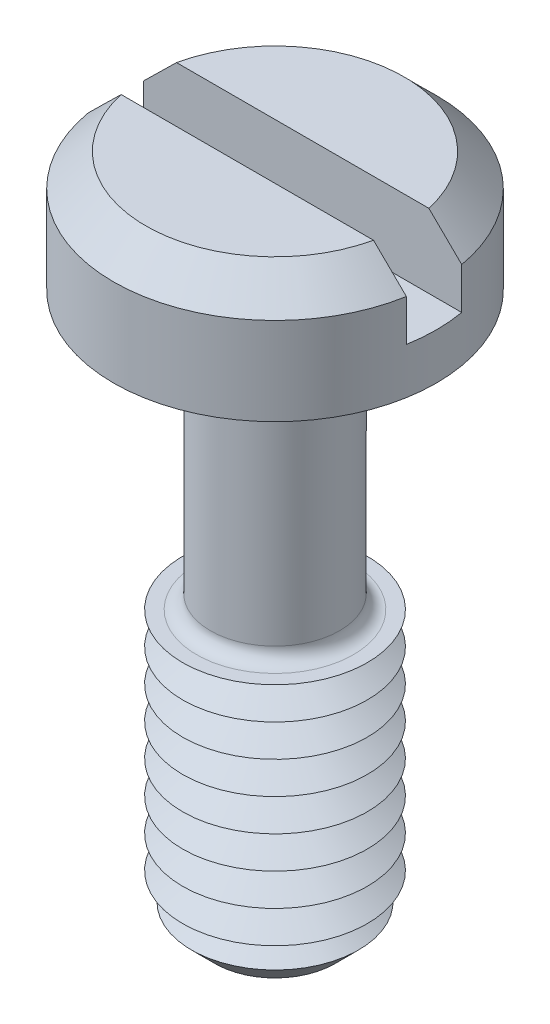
ISO-10303-21;
HEADER;
FILE_DESCRIPTION(('STEP AP214'),'2;1');
FILE_NAME('part.step','',(''),(''),'','','');
FILE_SCHEMA(('AUTOMOTIVE_DESIGN { 1 0 10303 214 1 1 1 1 }'));
ENDSEC;
DATA;
#1=APPLICATION_CONTEXT('core data for automotive mechanical design processes');
#2=APPLICATION_PROTOCOL_DEFINITION('international standard','automotive_design',2000,#1);
#3=PRODUCT_CONTEXT('',#1,'mechanical');
#4=PRODUCT('Part','Part','',(#3));
#5=PRODUCT_RELATED_PRODUCT_CATEGORY('part','',(#4));
#6=PRODUCT_DEFINITION_FORMATION('','',#4);
#7=PRODUCT_DEFINITION_CONTEXT('part definition',#1,'design');
#8=PRODUCT_DEFINITION('design','',#6,#7);
#9=PRODUCT_DEFINITION_SHAPE('','',#8);
#10=(LENGTH_UNIT() NAMED_UNIT(*) SI_UNIT(.MILLI.,.METRE.));
#11=(NAMED_UNIT(*) PLANE_ANGLE_UNIT() SI_UNIT($,.RADIAN.));
#12=(NAMED_UNIT(*) SI_UNIT($,.STERADIAN.) SOLID_ANGLE_UNIT());
#13=UNCERTAINTY_MEASURE_WITH_UNIT(LENGTH_MEASURE(1.E-05),#10,'distance_accuracy_value','');
#14=(GEOMETRIC_REPRESENTATION_CONTEXT(3) GLOBAL_UNCERTAINTY_ASSIGNED_CONTEXT((#13)) GLOBAL_UNIT_ASSIGNED_CONTEXT((#10,
#11,#12)) REPRESENTATION_CONTEXT('',''));
#15=CARTESIAN_POINT('',(0.,0.,0.));
#16=DIRECTION('',(0.,0.,1.));
#17=DIRECTION('',(1.,0.,0.));
#18=AXIS2_PLACEMENT_3D('',#15,#16,#17);
#19=CARTESIAN_POINT('',(0.,2.6,0.));
#20=DIRECTION('',(0.,1.,0.));
#21=DIRECTION('',(0.,0.,1.));
#22=AXIS2_PLACEMENT_3D('',#19,#20,#21);
#23=PLANE('',#22);
#24=DIRECTION('',(-1.,0.,0.));
#25=VECTOR('',#24,1.);
#26=CARTESIAN_POINT('',(3.5,2.6,-0.6));
#27=LINE('',#26,#25);
#28=CARTESIAN_POINT('',(2.73495886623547,2.6,-0.6));
#29=VERTEX_POINT('',#28);
#30=CARTESIAN_POINT('',(-2.73495886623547,2.6,-0.6));
#31=VERTEX_POINT('',#30);
#32=EDGE_CURVE('E110',#29,#31,#27,.T.);
#33=ORIENTED_EDGE('',*,*,#32,.F.);
#34=CARTESIAN_POINT('',(0.,2.6,0.));
#35=DIRECTION('',(0.,1.,0.));
#36=DIRECTION('',(0.,0.,1.));
#37=AXIS2_PLACEMENT_3D('',#34,#35,#36);
#38=CIRCLE('',#37,2.8);
#39=EDGE_CURVE('E113',#29,#31,#38,.T.);
#40=ORIENTED_EDGE('',*,*,#39,.T.);
#41=EDGE_LOOP('',(#33,#40));
#42=FACE_BOUND('',#41,.T.);
#43=ADVANCED_FACE('F39',(#42),#23,.T.);
#44=CARTESIAN_POINT('',(0.,2.6,0.));
#45=DIRECTION('',(0.,-1.,0.));
#46=DIRECTION('',(0.,0.,-1.));
#47=AXIS2_PLACEMENT_3D('',#44,#45,#46);
#48=CONICAL_SURFACE('',#47,2.8,0.785398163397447);
#49=CARTESIAN_POINT('',(7.69779986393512,-2.32114776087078,-0.6));
#50=CARTESIAN_POINT('',(7.42456340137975,-2.0487448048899,-0.6));
#51=CARTESIAN_POINT('',(7.15128998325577,-1.77637887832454,-0.6));
#52=CARTESIAN_POINT('',(6.60460779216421,-1.23176088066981,-0.6));
#53=CARTESIAN_POINT('',(6.3311990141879,-0.959508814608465,-0.6));
#54=CARTESIAN_POINT('',(5.78393918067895,-0.414914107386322,-0.6));
#55=CARTESIAN_POINT('',(5.51008795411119,-0.142571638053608,-0.6));
#56=CARTESIAN_POINT('',(4.96212493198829,0.401829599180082,-0.6));
#57=CARTESIAN_POINT('',(4.68801314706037,0.673888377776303,-0.6));
#58=CARTESIAN_POINT('',(4.15230810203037,1.20471714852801,-0.6));
#59=CARTESIAN_POINT('',(3.89073524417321,1.46350771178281,-0.6));
#60=CARTESIAN_POINT('',(3.49781694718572,1.85115830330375,-0.6));
#61=CARTESIAN_POINT('',(3.36674319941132,1.98029362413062,-0.6));
#62=CARTESIAN_POINT('',(3.10433907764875,2.23830030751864,-0.6));
#63=CARTESIAN_POINT('',(2.97300870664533,2.36717167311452,-0.6));
#64=CARTESIAN_POINT('',(2.71005235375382,2.62445652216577,-0.6));
#65=CARTESIAN_POINT('',(2.57842659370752,2.7528702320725,-0.6));
#66=CARTESIAN_POINT('',(2.31459302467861,3.00911021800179,-0.6));
#67=CARTESIAN_POINT('',(2.1823851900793,3.13693646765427,-0.6));
#68=CARTESIAN_POINT('',(1.91706128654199,3.39159289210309,-0.6));
#69=CARTESIAN_POINT('',(1.78394541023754,3.51842326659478,-0.6));
#70=CARTESIAN_POINT('',(1.5829745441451,3.70728046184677,-0.6));
#71=CARTESIAN_POINT('',(1.51577053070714,3.76999922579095,-0.6));
#72=CARTESIAN_POINT('',(1.38073587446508,3.89475766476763,-0.6));
#73=CARTESIAN_POINT('',(1.31290524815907,3.95679735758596,-0.6));
#74=CARTESIAN_POINT('',(1.20662362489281,4.05253127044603,-0.6));
#75=CARTESIAN_POINT('',(1.16849592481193,4.08658409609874,-0.6));
#76=CARTESIAN_POINT('',(1.09186306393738,4.15427097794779,-0.6));
#77=CARTESIAN_POINT('',(1.05335786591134,4.18790499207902,-0.6));
#78=CARTESIAN_POINT('',(0.975560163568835,4.25487029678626,-0.6));
#79=CARTESIAN_POINT('',(0.93626386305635,4.28819718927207,-0.6));
#80=CARTESIAN_POINT('',(0.857023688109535,4.35405392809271,-0.6));
#81=CARTESIAN_POINT('',(0.81707998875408,4.38658398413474,-0.6));
#82=CARTESIAN_POINT('',(0.735932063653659,4.45080389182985,-0.6));
#83=CARTESIAN_POINT('',(0.694719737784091,4.48248357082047,-0.6));
#84=CARTESIAN_POINT('',(0.611023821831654,4.54411116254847,-0.6));
#85=CARTESIAN_POINT('',(0.568540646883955,4.57405963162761,-0.6));
#86=CARTESIAN_POINT('',(0.482031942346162,4.63104137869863,-0.6));
#87=CARTESIAN_POINT('',(0.438018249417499,4.65809235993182,-0.6));
#88=CARTESIAN_POINT('',(0.347545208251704,4.70764477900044,-0.6));
#89=CARTESIAN_POINT('',(0.301093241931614,4.73015905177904,-0.6));
#90=CARTESIAN_POINT('',(0.216840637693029,4.76288589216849,-0.6));
#91=CARTESIAN_POINT('',(0.179711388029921,4.77476119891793,-0.6));
#92=CARTESIAN_POINT('',(0.104069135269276,4.79214056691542,-0.6));
#93=CARTESIAN_POINT('',(0.0655630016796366,4.79767265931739,-0.6));
#94=CARTESIAN_POINT('',(-0.0121083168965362,4.80113734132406,-0.6));
#95=CARTESIAN_POINT('',(-0.0512762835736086,4.79901215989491,-0.6));
#96=CARTESIAN_POINT('',(-0.128601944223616,4.78758103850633,-0.6));
#97=CARTESIAN_POINT('',(-0.166755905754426,4.77825158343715,-0.6));
#98=CARTESIAN_POINT('',(-0.239985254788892,4.75468984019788,-0.6));
#99=CARTESIAN_POINT('',(-0.275121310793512,4.74063623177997,-0.6));
#100=CARTESIAN_POINT('',(-0.343859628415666,4.70912771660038,-0.6));
#101=CARTESIAN_POINT('',(-0.37745919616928,4.69166709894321,-0.6));
#102=CARTESIAN_POINT('',(-0.443620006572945,4.65431398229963,-0.6));
#103=CARTESIAN_POINT('',(-0.476170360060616,4.63440256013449,-0.6));
#104=CARTESIAN_POINT('',(-0.540208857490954,4.59301144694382,-0.6));
#105=CARTESIAN_POINT('',(-0.571697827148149,4.57153301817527,-0.6));
#106=CARTESIAN_POINT('',(-0.636426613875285,4.5256571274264,-0.6));
#107=CARTESIAN_POINT('',(-0.669598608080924,4.50116466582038,-0.6));
#108=CARTESIAN_POINT('',(-0.735238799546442,4.45125092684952,-0.6));
#109=CARTESIAN_POINT('',(-0.767706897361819,4.42582951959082,-0.6));
#110=CARTESIAN_POINT('',(-0.864340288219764,4.34853769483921,-0.6));
#111=CARTESIAN_POINT('',(-0.927700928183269,4.29566444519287,-0.6));
#112=CARTESIAN_POINT('',(-1.05322030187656,4.18829389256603,-0.6));
#113=CARTESIAN_POINT('',(-1.11537654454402,4.13379371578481,-0.6));
#114=CARTESIAN_POINT('',(-1.23879800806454,4.02383276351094,-0.6));
#115=CARTESIAN_POINT('',(-1.30006349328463,3.96837228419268,-0.6));
#116=CARTESIAN_POINT('',(-1.42182653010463,3.85695373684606,-0.6));
#117=CARTESIAN_POINT('',(-1.48232573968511,3.80099747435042,-0.6));
#118=CARTESIAN_POINT('',(-1.602900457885,3.68862177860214,-0.6));
#119=CARTESIAN_POINT('',(-1.66297593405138,3.63220231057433,-0.6));
#120=CARTESIAN_POINT('',(-1.84259490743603,3.46258196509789,-0.6));
#121=CARTESIAN_POINT('',(-1.96167258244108,3.34888831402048,-0.6));
#122=CARTESIAN_POINT('',(-2.19942862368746,3.12043467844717,-0.6));
#123=CARTESIAN_POINT('',(-2.31810499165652,3.00567262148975,-0.6));
#124=CARTESIAN_POINT('',(-2.55498513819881,2.77566147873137,-0.6));
#125=CARTESIAN_POINT('',(-2.67318891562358,2.66041239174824,-0.6));
#126=CARTESIAN_POINT('',(-3.02733776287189,2.31418176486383,-0.6));
#127=CARTESIAN_POINT('',(-3.26281496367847,2.08272206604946,-0.6));
#128=CARTESIAN_POINT('',(-3.7332660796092,1.61902814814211,-0.6));
#129=CARTESIAN_POINT('',(-3.96823963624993,1.38679356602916,-0.6));
#130=CARTESIAN_POINT('',(-4.43780370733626,0.92194241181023,-0.6));
#131=CARTESIAN_POINT('',(-4.67239422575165,0.6893258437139,-0.6));
#132=CARTESIAN_POINT('',(-5.13982382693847,0.225350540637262,-0.6));
#133=CARTESIAN_POINT('',(-5.37266445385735,-0.00600663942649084,-0.6));
#134=CARTESIAN_POINT('',(-5.83818541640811,-0.468883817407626,-0.6));
#135=CARTESIAN_POINT('',(-6.07086575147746,-0.700403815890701,-0.6));
#136=CARTESIAN_POINT('',(-6.53596926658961,-1.16341429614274,-0.6));
#137=CARTESIAN_POINT('',(-6.76839251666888,-1.39490470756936,-0.6));
#138=CARTESIAN_POINT('',(-7.23315324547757,-1.85796986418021,-0.6));
#139=CARTESIAN_POINT('',(-7.46549072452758,-2.08954460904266,-0.6));
#140=CARTESIAN_POINT('',(-7.69779986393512,-2.32114776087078,-0.6));
#141=B_SPLINE_CURVE_WITH_KNOTS('',3,(#49,#50,#51,#52,#53,#54,#55,#56,#57,#58,#59,#60,#61,#62,
#63,#64,#65,#66,#67,#68,#69,#70,#71,#72,#73,#74,#75,#76,#77,#78,#79,#80,#81,#82,#83,#84,#85,#86,
#87,#88,#89,#90,#91,#92,#93,#94,#95,#96,#97,#98,#99,#100,#101,#102,#103,#104,#105,#106,#107,
#108,#109,#110,#111,#112,#113,#114,#115,#116,#117,#118,#119,#120,#121,#122,#123,#124,#125,#126,
#127,#128,#129,#130,#131,#132,#133,#134,#135,#136,#137,#138,#139,#140),.UNSPECIFIED.,.F.,.F.,(4,
2,2,2,2,2,2,2,2,2,2,2,2,2,2,2,2,2,2,2,2,2,2,2,2,2,2,2,2,2,2,2,2,2,2,2,2,2,2,2,2,2,2,2,2,4),(0.,
1.15747738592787,2.31500139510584,3.47365747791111,4.63226817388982,5.73614050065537,
6.28814234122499,6.84013779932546,7.39180548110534,7.94349768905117,8.49507629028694,
8.77084567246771,9.04660781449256,9.19996738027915,9.35334222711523,9.50791164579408,
9.66243993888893,9.81835637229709,9.9742224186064,10.1290741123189,10.2834813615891,
10.4000294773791,10.5160605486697,10.6329688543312,10.7502603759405,10.8635386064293,
10.9770083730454,11.0914168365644,11.205734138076,11.3294140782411,11.4531113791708,
11.7006314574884,11.9486181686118,12.1965297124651,12.4437540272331,12.6909970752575,
13.184904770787,13.6801705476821,14.1754375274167,15.1659939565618,16.1571087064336,
17.1482131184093,18.1329303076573,19.1176509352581,20.1017623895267,21.0858701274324),.UNSPECIFIED.);
#142=CARTESIAN_POINT('',(3.44818792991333,1.9,-0.6));
#143=VERTEX_POINT('',#142);
#144=EDGE_CURVE('E260',#143,#29,#141,.T.);
#145=ORIENTED_EDGE('',*,*,#144,.F.);
#146=CARTESIAN_POINT('',(0.,1.9,0.));
#147=DIRECTION('',(0.,1.,0.));
#148=DIRECTION('',(0.,0.,1.));
#149=AXIS2_PLACEMENT_3D('',#146,#147,#148);
#150=CIRCLE('',#149,3.5);
#151=CARTESIAN_POINT('',(-3.44818792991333,1.9,-0.6));
#152=VERTEX_POINT('',#151);
#153=EDGE_CURVE('E128',#152,#143,#150,.F.);
#154=ORIENTED_EDGE('',*,*,#153,.F.);
#155=EDGE_CURVE('E102',#31,#152,#141,.T.);
#156=ORIENTED_EDGE('',*,*,#155,.F.);
#157=ORIENTED_EDGE('',*,*,#39,.F.);
#158=EDGE_LOOP('',(#145,#154,#156,#157));
#159=FACE_BOUND('',#158,.T.);
#160=ADVANCED_FACE('F222',(#159),#48,.T.);
#161=CARTESIAN_POINT('',(0.,-12.,0.));
#162=DIRECTION('',(0.,1.,0.));
#163=DIRECTION('',(0.,0.,1.));
#164=AXIS2_PLACEMENT_3D('',#161,#162,#163);
#165=CYLINDRICAL_SURFACE('',#164,1.4);
#166=CARTESIAN_POINT('',(0.,-5.7,0.));
#167=DIRECTION('',(0.,-1.,0.));
#168=DIRECTION('',(0.,0.,-1.));
#169=AXIS2_PLACEMENT_3D('',#166,#167,#168);
#170=CIRCLE('',#169,1.4);
#171=CARTESIAN_POINT('',(0.,-5.7,-1.4));
#172=VERTEX_POINT('',#171);
#173=EDGE_CURVE('E123',#172,#172,#170,.F.);
#174=ORIENTED_EDGE('',*,*,#173,.T.);
#175=EDGE_LOOP('',(#174));
#176=FACE_BOUND('',#175,.T.);
#177=CARTESIAN_POINT('',(0.,-0.3,0.));
#178=DIRECTION('',(0.,1.,0.));
#179=DIRECTION('',(0.,0.,1.));
#180=AXIS2_PLACEMENT_3D('',#177,#178,#179);
#181=CIRCLE('',#180,1.4);
#182=CARTESIAN_POINT('',(0.,-0.3,1.4));
#183=VERTEX_POINT('',#182);
#184=EDGE_CURVE('E368',#183,#183,#181,.F.);
#185=ORIENTED_EDGE('',*,*,#184,.T.);
#186=EDGE_LOOP('',(#185));
#187=FACE_BOUND('',#186,.T.);
#188=ADVANCED_FACE('F218',(#176,#187),#165,.T.);
#189=CARTESIAN_POINT('',(0.,2.6,0.));
#190=DIRECTION('',(0.,-1.,0.));
#191=DIRECTION('',(0.,0.,-1.));
#192=AXIS2_PLACEMENT_3D('',#189,#190,#191);
#193=CYLINDRICAL_SURFACE('',#192,3.5);
#194=ORIENTED_EDGE('',*,*,#153,.T.);
#195=DIRECTION('',(0.,-1.,0.));
#196=VECTOR('',#195,1.);
#197=CARTESIAN_POINT('',(3.44818792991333,2.6,-0.6));
#198=LINE('',#197,#196);
#199=CARTESIAN_POINT('',(3.44818792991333,1.,-0.6));
#200=VERTEX_POINT('',#199);
#201=EDGE_CURVE('E64',#143,#200,#198,.T.);
#202=ORIENTED_EDGE('',*,*,#201,.T.);
#203=CARTESIAN_POINT('',(0.,1.,0.));
#204=DIRECTION('',(0.,1.,0.));
#205=DIRECTION('',(0.,0.,1.));
#206=AXIS2_PLACEMENT_3D('',#203,#204,#205);
#207=CIRCLE('',#206,3.5);
#208=CARTESIAN_POINT('',(3.44818792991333,1.,0.6));
#209=VERTEX_POINT('',#208);
#210=EDGE_CURVE('E11',#209,#200,#207,.T.);
#211=ORIENTED_EDGE('',*,*,#210,.F.);
#212=DIRECTION('',(0.,-1.,0.));
#213=VECTOR('',#212,1.);
#214=CARTESIAN_POINT('',(3.44818792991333,2.6,0.6));
#215=LINE('',#214,#213);
#216=CARTESIAN_POINT('',(3.44818792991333,1.9,0.6));
#217=VERTEX_POINT('',#216);
#218=EDGE_CURVE('E278',#209,#217,#215,.F.);
#219=ORIENTED_EDGE('',*,*,#218,.T.);
#220=CARTESIAN_POINT('',(-3.44818792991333,1.9,0.6));
#221=VERTEX_POINT('',#220);
#222=EDGE_CURVE('E120',#217,#221,#150,.F.);
#223=ORIENTED_EDGE('',*,*,#222,.T.);
#224=DIRECTION('',(0.,-1.,0.));
#225=VECTOR('',#224,1.);
#226=CARTESIAN_POINT('',(-3.44818792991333,2.6,0.6));
#227=LINE('',#226,#225);
#228=CARTESIAN_POINT('',(-3.44818792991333,1.,0.6));
#229=VERTEX_POINT('',#228);
#230=EDGE_CURVE('E96',#221,#229,#227,.T.);
#231=ORIENTED_EDGE('',*,*,#230,.T.);
#232=CARTESIAN_POINT('',(-3.44818792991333,1.,-0.6));
#233=VERTEX_POINT('',#232);
#234=EDGE_CURVE('E44',#233,#229,#207,.T.);
#235=ORIENTED_EDGE('',*,*,#234,.F.);
#236=DIRECTION('',(0.,-1.,0.));
#237=VECTOR('',#236,1.);
#238=CARTESIAN_POINT('',(-3.44818792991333,2.6,-0.6));
#239=LINE('',#238,#237);
#240=EDGE_CURVE('E282',#233,#152,#239,.F.);
#241=ORIENTED_EDGE('',*,*,#240,.T.);
#242=EDGE_LOOP('',(#194,#202,#211,#219,#223,#231,#235,#241));
#243=FACE_BOUND('',#242,.T.);
#244=CARTESIAN_POINT('',(0.,0.,0.));
#245=DIRECTION('',(0.,1.,0.));
#246=DIRECTION('',(0.,0.,1.));
#247=AXIS2_PLACEMENT_3D('',#244,#245,#246);
#248=CIRCLE('',#247,3.5);
#249=CARTESIAN_POINT('',(0.,0.,3.5));
#250=VERTEX_POINT('',#249);
#251=EDGE_CURVE('E354',#250,#250,#248,.T.);
#252=ORIENTED_EDGE('',*,*,#251,.T.);
#253=EDGE_LOOP('',(#252));
#254=FACE_BOUND('',#253,.T.);
#255=ADVANCED_FACE('F221',(#243,#254),#193,.T.);
#256=DIRECTION('',(1.,0.,0.));
#257=VECTOR('',#256,1.);
#258=CARTESIAN_POINT('',(3.5,2.6,0.6));
#259=LINE('',#258,#257);
#260=CARTESIAN_POINT('',(-2.73495886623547,2.6,0.6));
#261=VERTEX_POINT('',#260);
#262=CARTESIAN_POINT('',(2.73495886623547,2.6,0.6));
#263=VERTEX_POINT('',#262);
#264=EDGE_CURVE('E56',#261,#263,#259,.T.);
#265=ORIENTED_EDGE('',*,*,#264,.F.);
#266=EDGE_CURVE('E108',#261,#263,#38,.T.);
#267=ORIENTED_EDGE('',*,*,#266,.T.);
#268=EDGE_LOOP('',(#265,#267));
#269=FACE_BOUND('',#268,.T.);
#270=ADVANCED_FACE('F107',(#269),#23,.T.);
#271=CARTESIAN_POINT('',(0.,0.,0.));
#272=DIRECTION('',(0.,1.,0.));
#273=DIRECTION('',(0.,0.,1.));
#274=AXIS2_PLACEMENT_3D('',#271,#272,#273);
#275=PLANE('',#274);
#276=CARTESIAN_POINT('',(0.,0.,0.));
#277=DIRECTION('',(0.,1.,0.));
#278=DIRECTION('',(0.,0.,1.));
#279=AXIS2_PLACEMENT_3D('',#276,#277,#278);
#280=CIRCLE('',#279,1.7);
#281=CARTESIAN_POINT('',(0.,0.,1.7));
#282=VERTEX_POINT('',#281);
#283=EDGE_CURVE('E114',#282,#282,#280,.T.);
#284=ORIENTED_EDGE('',*,*,#283,.T.);
#285=EDGE_LOOP('',(#284));
#286=FACE_BOUND('',#285,.T.);
#287=ORIENTED_EDGE('',*,*,#251,.F.);
#288=EDGE_LOOP('',(#287));
#289=FACE_BOUND('',#288,.T.);
#290=ADVANCED_FACE('F212',(#286,#289),#275,.F.);
#291=CARTESIAN_POINT('',(0.,-6.,0.));
#292=DIRECTION('',(0.,-1.,0.));
#293=DIRECTION('',(0.,0.,-1.));
#294=AXIS2_PLACEMENT_3D('',#291,#292,#293);
#295=PLANE('',#294);
#296=CARTESIAN_POINT('',(0.,-6.,0.));
#297=DIRECTION('',(0.,-1.,0.));
#298=DIRECTION('',(0.,0.,-1.));
#299=AXIS2_PLACEMENT_3D('',#296,#297,#298);
#300=CIRCLE('',#299,1.7);
#301=CARTESIAN_POINT('',(0.,-6.,-1.7));
#302=VERTEX_POINT('',#301);
#303=EDGE_CURVE('E362',#302,#302,#300,.T.);
#304=ORIENTED_EDGE('',*,*,#303,.T.);
#305=EDGE_LOOP('',(#304));
#306=FACE_BOUND('',#305,.T.);
#307=CARTESIAN_POINT('',(0.,-6.,0.));
#308=DIRECTION('',(0.,1.,0.));
#309=DIRECTION('',(0.,0.,1.));
#310=AXIS2_PLACEMENT_3D('',#307,#308,#309);
#311=CIRCLE('',#310,2.);
#312=CARTESIAN_POINT('',(0.,-6.,2.));
#313=VERTEX_POINT('',#312);
#314=EDGE_CURVE('E350',#313,#313,#311,.T.);
#315=ORIENTED_EDGE('',*,*,#314,.T.);
#316=EDGE_LOOP('',(#315));
#317=FACE_BOUND('',#316,.T.);
#318=ADVANCED_FACE('F208',(#306,#317),#295,.F.);
#319=CARTESIAN_POINT('',(0.,-6.35,0.));
#320=DIRECTION('',(0.,1.,0.));
#321=DIRECTION('',(0.,0.,1.));
#322=AXIS2_PLACEMENT_3D('',#319,#320,#321);
#323=CONICAL_SURFACE('',#322,1.39378221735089,1.0471975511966);
#324=ORIENTED_EDGE('',*,*,#314,.F.);
#325=EDGE_LOOP('',(#324));
#326=FACE_BOUND('',#325,.T.);
#327=CARTESIAN_POINT('',(0.,-6.35,0.));
#328=DIRECTION('',(0.,1.,0.));
#329=DIRECTION('',(0.,0.,1.));
#330=AXIS2_PLACEMENT_3D('',#327,#328,#329);
#331=CIRCLE('',#330,1.39378221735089);
#332=CARTESIAN_POINT('',(0.,-6.35,1.39378221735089));
#333=VERTEX_POINT('',#332);
#334=EDGE_CURVE('E346',#333,#333,#331,.T.);
#335=ORIENTED_EDGE('',*,*,#334,.T.);
#336=EDGE_LOOP('',(#335));
#337=FACE_BOUND('',#336,.T.);
#338=ADVANCED_FACE('F204',(#326,#337),#323,.T.);
#339=CARTESIAN_POINT('',(0.,-6.7,0.));
#340=DIRECTION('',(0.,-1.,0.));
#341=DIRECTION('',(0.,0.,-1.));
#342=AXIS2_PLACEMENT_3D('',#339,#340,#341);
#343=CONICAL_SURFACE('',#342,2.,1.0471975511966);
#344=ORIENTED_EDGE('',*,*,#334,.F.);
#345=EDGE_LOOP('',(#344));
#346=FACE_BOUND('',#345,.T.);
#347=CARTESIAN_POINT('',(0.,-6.7,0.));
#348=DIRECTION('',(0.,1.,0.));
#349=DIRECTION('',(0.,0.,1.));
#350=AXIS2_PLACEMENT_3D('',#347,#348,#349);
#351=CIRCLE('',#350,2.);
#352=CARTESIAN_POINT('',(0.,-6.7,2.));
#353=VERTEX_POINT('',#352);
#354=EDGE_CURVE('E342',#353,#353,#351,.T.);
#355=ORIENTED_EDGE('',*,*,#354,.T.);
#356=EDGE_LOOP('',(#355));
#357=FACE_BOUND('',#356,.T.);
#358=ADVANCED_FACE('F200',(#346,#357),#343,.T.);
#359=CARTESIAN_POINT('',(0.,-7.05,0.));
#360=DIRECTION('',(0.,1.,0.));
#361=DIRECTION('',(0.,0.,1.));
#362=AXIS2_PLACEMENT_3D('',#359,#360,#361);
#363=CONICAL_SURFACE('',#362,1.39378221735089,1.0471975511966);
#364=ORIENTED_EDGE('',*,*,#354,.F.);
#365=EDGE_LOOP('',(#364));
#366=FACE_BOUND('',#365,.T.);
#367=CARTESIAN_POINT('',(0.,-7.05,0.));
#368=DIRECTION('',(0.,1.,0.));
#369=DIRECTION('',(0.,0.,1.));
#370=AXIS2_PLACEMENT_3D('',#367,#368,#369);
#371=CIRCLE('',#370,1.39378221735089);
#372=CARTESIAN_POINT('',(0.,-7.05,1.39378221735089));
#373=VERTEX_POINT('',#372);
#374=EDGE_CURVE('E339',#373,#373,#371,.T.);
#375=ORIENTED_EDGE('',*,*,#374,.T.);
#376=EDGE_LOOP('',(#375));
#377=FACE_BOUND('',#376,.T.);
#378=ADVANCED_FACE('F196',(#366,#377),#363,.T.);
#379=CARTESIAN_POINT('',(0.,-7.4,0.));
#380=DIRECTION('',(0.,-1.,0.));
#381=DIRECTION('',(0.,0.,-1.));
#382=AXIS2_PLACEMENT_3D('',#379,#380,#381);
#383=CONICAL_SURFACE('',#382,2.,1.0471975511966);
#384=ORIENTED_EDGE('',*,*,#374,.F.);
#385=EDGE_LOOP('',(#384));
#386=FACE_BOUND('',#385,.T.);
#387=CARTESIAN_POINT('',(0.,-7.4,0.));
#388=DIRECTION('',(0.,1.,0.));
#389=DIRECTION('',(0.,0.,1.));
#390=AXIS2_PLACEMENT_3D('',#387,#388,#389);
#391=CIRCLE('',#390,2.);
#392=CARTESIAN_POINT('',(0.,-7.4,2.));
#393=VERTEX_POINT('',#392);
#394=EDGE_CURVE('E335',#393,#393,#391,.T.);
#395=ORIENTED_EDGE('',*,*,#394,.T.);
#396=EDGE_LOOP('',(#395));
#397=FACE_BOUND('',#396,.T.);
#398=ADVANCED_FACE('F192',(#386,#397),#383,.T.);
#399=CARTESIAN_POINT('',(0.,-7.75,0.));
#400=DIRECTION('',(0.,1.,0.));
#401=DIRECTION('',(0.,0.,1.));
#402=AXIS2_PLACEMENT_3D('',#399,#400,#401);
#403=CONICAL_SURFACE('',#402,1.39378221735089,1.0471975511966);
#404=ORIENTED_EDGE('',*,*,#394,.F.);
#405=EDGE_LOOP('',(#404));
#406=FACE_BOUND('',#405,.T.);
#407=CARTESIAN_POINT('',(0.,-7.75,0.));
#408=DIRECTION('',(0.,1.,0.));
#409=DIRECTION('',(0.,0.,1.));
#410=AXIS2_PLACEMENT_3D('',#407,#408,#409);
#411=CIRCLE('',#410,1.39378221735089);
#412=CARTESIAN_POINT('',(0.,-7.75,1.39378221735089));
#413=VERTEX_POINT('',#412);
#414=EDGE_CURVE('E331',#413,#413,#411,.T.);
#415=ORIENTED_EDGE('',*,*,#414,.T.);
#416=EDGE_LOOP('',(#415));
#417=FACE_BOUND('',#416,.T.);
#418=ADVANCED_FACE('F188',(#406,#417),#403,.T.);
#419=CARTESIAN_POINT('',(0.,-8.1,0.));
#420=DIRECTION('',(0.,-1.,0.));
#421=DIRECTION('',(0.,0.,-1.));
#422=AXIS2_PLACEMENT_3D('',#419,#420,#421);
#423=CONICAL_SURFACE('',#422,2.,1.0471975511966);
#424=ORIENTED_EDGE('',*,*,#414,.F.);
#425=EDGE_LOOP('',(#424));
#426=FACE_BOUND('',#425,.T.);
#427=CARTESIAN_POINT('',(0.,-8.1,0.));
#428=DIRECTION('',(0.,1.,0.));
#429=DIRECTION('',(0.,0.,1.));
#430=AXIS2_PLACEMENT_3D('',#427,#428,#429);
#431=CIRCLE('',#430,2.);
#432=CARTESIAN_POINT('',(0.,-8.1,2.));
#433=VERTEX_POINT('',#432);
#434=EDGE_CURVE('E328',#433,#433,#431,.T.);
#435=ORIENTED_EDGE('',*,*,#434,.T.);
#436=EDGE_LOOP('',(#435));
#437=FACE_BOUND('',#436,.T.);
#438=ADVANCED_FACE('F184',(#426,#437),#423,.T.);
#439=CARTESIAN_POINT('',(0.,-8.45,0.));
#440=DIRECTION('',(0.,1.,0.));
#441=DIRECTION('',(0.,0.,1.));
#442=AXIS2_PLACEMENT_3D('',#439,#440,#441);
#443=CONICAL_SURFACE('',#442,1.39378221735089,1.0471975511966);
#444=ORIENTED_EDGE('',*,*,#434,.F.);
#445=EDGE_LOOP('',(#444));
#446=FACE_BOUND('',#445,.T.);
#447=CARTESIAN_POINT('',(0.,-8.45,0.));
#448=DIRECTION('',(0.,1.,0.));
#449=DIRECTION('',(0.,0.,1.));
#450=AXIS2_PLACEMENT_3D('',#447,#448,#449);
#451=CIRCLE('',#450,1.39378221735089);
#452=CARTESIAN_POINT('',(0.,-8.45,1.39378221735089));
#453=VERTEX_POINT('',#452);
#454=EDGE_CURVE('E325',#453,#453,#451,.T.);
#455=ORIENTED_EDGE('',*,*,#454,.T.);
#456=EDGE_LOOP('',(#455));
#457=FACE_BOUND('',#456,.T.);
#458=ADVANCED_FACE('F180',(#446,#457),#443,.T.);
#459=CARTESIAN_POINT('',(0.,-8.8,0.));
#460=DIRECTION('',(0.,-1.,0.));
#461=DIRECTION('',(0.,0.,-1.));
#462=AXIS2_PLACEMENT_3D('',#459,#460,#461);
#463=CONICAL_SURFACE('',#462,2.,1.0471975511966);
#464=ORIENTED_EDGE('',*,*,#454,.F.);
#465=EDGE_LOOP('',(#464));
#466=FACE_BOUND('',#465,.T.);
#467=CARTESIAN_POINT('',(0.,-8.8,0.));
#468=DIRECTION('',(0.,1.,0.));
#469=DIRECTION('',(0.,0.,1.));
#470=AXIS2_PLACEMENT_3D('',#467,#468,#469);
#471=CIRCLE('',#470,2.);
#472=CARTESIAN_POINT('',(0.,-8.8,2.));
#473=VERTEX_POINT('',#472);
#474=EDGE_CURVE('E321',#473,#473,#471,.T.);
#475=ORIENTED_EDGE('',*,*,#474,.T.);
#476=EDGE_LOOP('',(#475));
#477=FACE_BOUND('',#476,.T.);
#478=ADVANCED_FACE('F176',(#466,#477),#463,.T.);
#479=CARTESIAN_POINT('',(0.,-9.15,0.));
#480=DIRECTION('',(0.,1.,0.));
#481=DIRECTION('',(0.,0.,1.));
#482=AXIS2_PLACEMENT_3D('',#479,#480,#481);
#483=CONICAL_SURFACE('',#482,1.39378221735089,1.0471975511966);
#484=ORIENTED_EDGE('',*,*,#474,.F.);
#485=EDGE_LOOP('',(#484));
#486=FACE_BOUND('',#485,.T.);
#487=CARTESIAN_POINT('',(0.,-9.15,0.));
#488=DIRECTION('',(0.,1.,0.));
#489=DIRECTION('',(0.,0.,1.));
#490=AXIS2_PLACEMENT_3D('',#487,#488,#489);
#491=CIRCLE('',#490,1.39378221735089);
#492=CARTESIAN_POINT('',(0.,-9.15,1.39378221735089));
#493=VERTEX_POINT('',#492);
#494=EDGE_CURVE('E317',#493,#493,#491,.T.);
#495=ORIENTED_EDGE('',*,*,#494,.T.);
#496=EDGE_LOOP('',(#495));
#497=FACE_BOUND('',#496,.T.);
#498=ADVANCED_FACE('F172',(#486,#497),#483,.T.);
#499=CARTESIAN_POINT('',(0.,-9.5,0.));
#500=DIRECTION('',(0.,-1.,0.));
#501=DIRECTION('',(0.,0.,-1.));
#502=AXIS2_PLACEMENT_3D('',#499,#500,#501);
#503=CONICAL_SURFACE('',#502,2.,1.0471975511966);
#504=ORIENTED_EDGE('',*,*,#494,.F.);
#505=EDGE_LOOP('',(#504));
#506=FACE_BOUND('',#505,.T.);
#507=CARTESIAN_POINT('',(0.,-9.5,0.));
#508=DIRECTION('',(0.,1.,0.));
#509=DIRECTION('',(0.,0.,1.));
#510=AXIS2_PLACEMENT_3D('',#507,#508,#509);
#511=CIRCLE('',#510,2.);
#512=CARTESIAN_POINT('',(0.,-9.5,2.));
#513=VERTEX_POINT('',#512);
#514=EDGE_CURVE('E313',#513,#513,#511,.T.);
#515=ORIENTED_EDGE('',*,*,#514,.T.);
#516=EDGE_LOOP('',(#515));
#517=FACE_BOUND('',#516,.T.);
#518=ADVANCED_FACE('F168',(#506,#517),#503,.T.);
#519=CARTESIAN_POINT('',(0.,-9.85,0.));
#520=DIRECTION('',(0.,1.,0.));
#521=DIRECTION('',(0.,0.,1.));
#522=AXIS2_PLACEMENT_3D('',#519,#520,#521);
#523=CONICAL_SURFACE('',#522,1.39378221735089,1.0471975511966);
#524=ORIENTED_EDGE('',*,*,#514,.F.);
#525=EDGE_LOOP('',(#524));
#526=FACE_BOUND('',#525,.T.);
#527=CARTESIAN_POINT('',(0.,-9.85,0.));
#528=DIRECTION('',(0.,1.,0.));
#529=DIRECTION('',(0.,0.,1.));
#530=AXIS2_PLACEMENT_3D('',#527,#528,#529);
#531=CIRCLE('',#530,1.39378221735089);
#532=CARTESIAN_POINT('',(0.,-9.85,1.39378221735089));
#533=VERTEX_POINT('',#532);
#534=EDGE_CURVE('E309',#533,#533,#531,.T.);
#535=ORIENTED_EDGE('',*,*,#534,.T.);
#536=EDGE_LOOP('',(#535));
#537=FACE_BOUND('',#536,.T.);
#538=ADVANCED_FACE('F164',(#526,#537),#523,.T.);
#539=CARTESIAN_POINT('',(0.,-10.2,0.));
#540=DIRECTION('',(0.,-1.,0.));
#541=DIRECTION('',(0.,0.,-1.));
#542=AXIS2_PLACEMENT_3D('',#539,#540,#541);
#543=CONICAL_SURFACE('',#542,2.,1.0471975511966);
#544=ORIENTED_EDGE('',*,*,#534,.F.);
#545=EDGE_LOOP('',(#544));
#546=FACE_BOUND('',#545,.T.);
#547=CARTESIAN_POINT('',(0.,-10.2,0.));
#548=DIRECTION('',(0.,1.,0.));
#549=DIRECTION('',(0.,0.,1.));
#550=AXIS2_PLACEMENT_3D('',#547,#548,#549);
#551=CIRCLE('',#550,2.);
#552=CARTESIAN_POINT('',(0.,-10.2,2.));
#553=VERTEX_POINT('',#552);
#554=EDGE_CURVE('E305',#553,#553,#551,.T.);
#555=ORIENTED_EDGE('',*,*,#554,.T.);
#556=EDGE_LOOP('',(#555));
#557=FACE_BOUND('',#556,.T.);
#558=ADVANCED_FACE('F160',(#546,#557),#543,.T.);
#559=CARTESIAN_POINT('',(0.,-10.55,0.));
#560=DIRECTION('',(0.,1.,0.));
#561=DIRECTION('',(0.,0.,1.));
#562=AXIS2_PLACEMENT_3D('',#559,#560,#561);
#563=CONICAL_SURFACE('',#562,1.39378221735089,1.0471975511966);
#564=ORIENTED_EDGE('',*,*,#554,.F.);
#565=EDGE_LOOP('',(#564));
#566=FACE_BOUND('',#565,.T.);
#567=CARTESIAN_POINT('',(0.,-10.55,0.));
#568=DIRECTION('',(0.,1.,0.));
#569=DIRECTION('',(0.,0.,1.));
#570=AXIS2_PLACEMENT_3D('',#567,#568,#569);
#571=CIRCLE('',#570,1.39378221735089);
#572=CARTESIAN_POINT('',(0.,-10.55,1.39378221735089));
#573=VERTEX_POINT('',#572);
#574=EDGE_CURVE('E301',#573,#573,#571,.T.);
#575=ORIENTED_EDGE('',*,*,#574,.T.);
#576=EDGE_LOOP('',(#575));
#577=FACE_BOUND('',#576,.T.);
#578=ADVANCED_FACE('F156',(#566,#577),#563,.T.);
#579=CARTESIAN_POINT('',(0.,-10.9,0.));
#580=DIRECTION('',(0.,-1.,0.));
#581=DIRECTION('',(0.,0.,-1.));
#582=AXIS2_PLACEMENT_3D('',#579,#580,#581);
#583=CONICAL_SURFACE('',#582,2.,1.0471975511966);
#584=ORIENTED_EDGE('',*,*,#574,.F.);
#585=EDGE_LOOP('',(#584));
#586=FACE_BOUND('',#585,.T.);
#587=CARTESIAN_POINT('',(0.,-10.9,0.));
#588=DIRECTION('',(0.,1.,0.));
#589=DIRECTION('',(0.,0.,1.));
#590=AXIS2_PLACEMENT_3D('',#587,#588,#589);
#591=CIRCLE('',#590,2.);
#592=CARTESIAN_POINT('',(0.,-10.9,2.));
#593=VERTEX_POINT('',#592);
#594=EDGE_CURVE('E296',#593,#593,#591,.T.);
#595=ORIENTED_EDGE('',*,*,#594,.T.);
#596=EDGE_LOOP('',(#595));
#597=FACE_BOUND('',#596,.T.);
#598=ADVANCED_FACE('F152',(#586,#597),#583,.T.);
#599=CARTESIAN_POINT('',(0.,-11.25,0.));
#600=DIRECTION('',(0.,1.,0.));
#601=DIRECTION('',(0.,0.,1.));
#602=AXIS2_PLACEMENT_3D('',#599,#600,#601);
#603=CONICAL_SURFACE('',#602,1.39378221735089,1.0471975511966);
#604=ORIENTED_EDGE('',*,*,#594,.F.);
#605=EDGE_LOOP('',(#604));
#606=FACE_BOUND('',#605,.T.);
#607=CARTESIAN_POINT('',(0.,-11.25,0.));
#608=DIRECTION('',(0.,1.,0.));
#609=DIRECTION('',(0.,0.,1.));
#610=AXIS2_PLACEMENT_3D('',#607,#608,#609);
#611=CIRCLE('',#610,1.39378221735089);
#612=CARTESIAN_POINT('',(0.,-11.25,1.39378221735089));
#613=VERTEX_POINT('',#612);
#614=EDGE_CURVE('E292',#613,#613,#611,.T.);
#615=ORIENTED_EDGE('',*,*,#614,.T.);
#616=EDGE_LOOP('',(#615));
#617=FACE_BOUND('',#616,.T.);
#618=ADVANCED_FACE('F148',(#606,#617),#603,.T.);
#619=CARTESIAN_POINT('',(0.,-11.6,0.));
#620=DIRECTION('',(0.,-1.,0.));
#621=DIRECTION('',(0.,0.,-1.));
#622=AXIS2_PLACEMENT_3D('',#619,#620,#621);
#623=CONICAL_SURFACE('',#622,2.,1.0471975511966);
#624=CARTESIAN_POINT('',(0.,-11.4901923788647,0.));
#625=DIRECTION('',(0.,-1.,0.));
#626=DIRECTION('',(0.,0.,-1.));
#627=AXIS2_PLACEMENT_3D('',#624,#625,#626);
#628=CIRCLE('',#627,1.80980762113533);
#629=CARTESIAN_POINT('',(0.,-11.4901923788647,-1.80980762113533));
#630=VERTEX_POINT('',#629);
#631=EDGE_CURVE('E300',#630,#630,#628,.F.);
#632=ORIENTED_EDGE('',*,*,#631,.T.);
#633=EDGE_LOOP('',(#632));
#634=FACE_BOUND('',#633,.T.);
#635=ORIENTED_EDGE('',*,*,#614,.F.);
#636=EDGE_LOOP('',(#635));
#637=FACE_BOUND('',#636,.T.);
#638=ADVANCED_FACE('F144',(#634,#637),#623,.T.);
#639=CARTESIAN_POINT('',(0.,-12.,0.));
#640=DIRECTION('',(0.,-1.,0.));
#641=DIRECTION('',(0.,0.,-1.));
#642=AXIS2_PLACEMENT_3D('',#639,#640,#641);
#643=PLANE('',#642);
#644=CARTESIAN_POINT('',(0.,-12.,0.));
#645=DIRECTION('',(0.,-1.,0.));
#646=DIRECTION('',(0.,0.,-1.));
#647=AXIS2_PLACEMENT_3D('',#644,#645,#646);
#648=CIRCLE('',#647,1.3);
#649=CARTESIAN_POINT('',(0.,-12.,-1.3));
#650=VERTEX_POINT('',#649);
#651=EDGE_CURVE('E358',#650,#650,#648,.T.);
#652=ORIENTED_EDGE('',*,*,#651,.T.);
#653=EDGE_LOOP('',(#652));
#654=FACE_BOUND('',#653,.T.);
#655=ADVANCED_FACE('F147',(#654),#643,.T.);
#656=CARTESIAN_POINT('',(0.,-12.,0.));
#657=DIRECTION('',(0.,1.,0.));
#658=DIRECTION('',(0.,0.,1.));
#659=AXIS2_PLACEMENT_3D('',#656,#657,#658);
#660=CONICAL_SURFACE('',#659,1.3,0.785398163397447);
#661=ORIENTED_EDGE('',*,*,#631,.F.);
#662=EDGE_LOOP('',(#661));
#663=FACE_BOUND('',#662,.T.);
#664=ORIENTED_EDGE('',*,*,#651,.F.);
#665=EDGE_LOOP('',(#664));
#666=FACE_BOUND('',#665,.T.);
#667=ADVANCED_FACE('F216',(#663,#666),#660,.T.);
#668=CARTESIAN_POINT('',(0.,-5.7,0.));
#669=DIRECTION('',(0.,-1.,0.));
#670=DIRECTION('',(0.,0.,-1.));
#671=AXIS2_PLACEMENT_3D('',#668,#669,#670);
#672=TOROIDAL_SURFACE('',#671,1.7,0.3);
#673=ORIENTED_EDGE('',*,*,#173,.F.);
#674=EDGE_LOOP('',(#673));
#675=FACE_BOUND('',#674,.T.);
#676=ORIENTED_EDGE('',*,*,#303,.F.);
#677=EDGE_LOOP('',(#676));
#678=FACE_BOUND('',#677,.T.);
#679=ADVANCED_FACE('F234',(#675,#678),#672,.F.);
#680=CARTESIAN_POINT('',(0.,-0.3,0.));
#681=DIRECTION('',(0.,1.,0.));
#682=DIRECTION('',(0.,0.,1.));
#683=AXIS2_PLACEMENT_3D('',#680,#681,#682);
#684=TOROIDAL_SURFACE('',#683,1.7,0.3);
#685=ORIENTED_EDGE('',*,*,#283,.F.);
#686=EDGE_LOOP('',(#685));
#687=FACE_BOUND('',#686,.T.);
#688=ORIENTED_EDGE('',*,*,#184,.F.);
#689=EDGE_LOOP('',(#688));
#690=FACE_BOUND('',#689,.T.);
#691=ADVANCED_FACE('F237',(#687,#690),#684,.F.);
#692=CARTESIAN_POINT('',(-7.69779986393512,-2.32114776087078,0.6));
#693=CARTESIAN_POINT('',(-7.42456340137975,-2.0487448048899,0.6));
#694=CARTESIAN_POINT('',(-7.15128998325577,-1.77637887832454,0.6));
#695=CARTESIAN_POINT('',(-6.60460779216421,-1.23176088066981,0.6));
#696=CARTESIAN_POINT('',(-6.33119901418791,-0.959508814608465,0.6));
#697=CARTESIAN_POINT('',(-5.78393918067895,-0.414914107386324,0.6));
#698=CARTESIAN_POINT('',(-5.51008795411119,-0.142571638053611,0.6));
#699=CARTESIAN_POINT('',(-4.96212493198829,0.401829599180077,0.6));
#700=CARTESIAN_POINT('',(-4.68801314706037,0.673888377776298,0.6));
#701=CARTESIAN_POINT('',(-4.15230810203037,1.204717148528,0.6));
#702=CARTESIAN_POINT('',(-3.89073524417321,1.46350771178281,0.6));
#703=CARTESIAN_POINT('',(-3.49781694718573,1.85115830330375,0.6));
#704=CARTESIAN_POINT('',(-3.36674319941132,1.98029362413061,0.6));
#705=CARTESIAN_POINT('',(-3.10433907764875,2.23830030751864,0.6));
#706=CARTESIAN_POINT('',(-2.97300870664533,2.36717167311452,0.6));
#707=CARTESIAN_POINT('',(-2.71005235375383,2.62445652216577,0.6));
#708=CARTESIAN_POINT('',(-2.57842659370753,2.75287023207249,0.6));
#709=CARTESIAN_POINT('',(-2.31459302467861,3.00911021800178,0.6));
#710=CARTESIAN_POINT('',(-2.1823851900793,3.13693646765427,0.6));
#711=CARTESIAN_POINT('',(-1.91706128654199,3.39159289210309,0.6));
#712=CARTESIAN_POINT('',(-1.78394541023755,3.51842326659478,0.6));
#713=CARTESIAN_POINT('',(-1.5829745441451,3.70728046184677,0.6));
#714=CARTESIAN_POINT('',(-1.51577053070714,3.76999922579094,0.6));
#715=CARTESIAN_POINT('',(-1.38073587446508,3.89475766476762,0.6));
#716=CARTESIAN_POINT('',(-1.31290524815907,3.95679735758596,0.6));
#717=CARTESIAN_POINT('',(-1.20662362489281,4.05253127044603,0.6));
#718=CARTESIAN_POINT('',(-1.16849592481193,4.08658409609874,0.6));
#719=CARTESIAN_POINT('',(-1.09186306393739,4.15427097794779,0.6));
#720=CARTESIAN_POINT('',(-1.05335786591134,4.18790499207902,0.6));
#721=CARTESIAN_POINT('',(-0.975560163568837,4.25487029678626,0.6));
#722=CARTESIAN_POINT('',(-0.936263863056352,4.28819718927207,0.6));
#723=CARTESIAN_POINT('',(-0.857023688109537,4.35405392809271,0.6));
#724=CARTESIAN_POINT('',(-0.817079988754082,4.38658398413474,0.6));
#725=CARTESIAN_POINT('',(-0.735932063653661,4.45080389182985,0.6));
#726=CARTESIAN_POINT('',(-0.694719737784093,4.48248357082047,0.6));
#727=CARTESIAN_POINT('',(-0.611023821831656,4.54411116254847,0.6));
#728=CARTESIAN_POINT('',(-0.568540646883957,4.57405963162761,0.6));
#729=CARTESIAN_POINT('',(-0.482031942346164,4.63104137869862,0.6));
#730=CARTESIAN_POINT('',(-0.4380182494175,4.65809235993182,0.6));
#731=CARTESIAN_POINT('',(-0.347545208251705,4.70764477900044,0.6));
#732=CARTESIAN_POINT('',(-0.301093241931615,4.73015905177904,0.6));
#733=CARTESIAN_POINT('',(-0.21684063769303,4.76288589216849,0.6));
#734=CARTESIAN_POINT('',(-0.179711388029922,4.77476119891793,0.6));
#735=CARTESIAN_POINT('',(-0.104069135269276,4.79214056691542,0.6));
#736=CARTESIAN_POINT('',(-0.0655630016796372,4.79767265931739,0.6));
#737=CARTESIAN_POINT('',(0.0121083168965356,4.80113734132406,0.6));
#738=CARTESIAN_POINT('',(0.0512762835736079,4.79901215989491,0.6));
#739=CARTESIAN_POINT('',(0.128601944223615,4.78758103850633,0.6));
#740=CARTESIAN_POINT('',(0.166755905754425,4.77825158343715,0.6));
#741=CARTESIAN_POINT('',(0.239985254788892,4.75468984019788,0.6));
#742=CARTESIAN_POINT('',(0.275121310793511,4.74063623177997,0.6));
#743=CARTESIAN_POINT('',(0.343859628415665,4.70912771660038,0.6));
#744=CARTESIAN_POINT('',(0.377459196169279,4.69166709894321,0.6));
#745=CARTESIAN_POINT('',(0.443620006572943,4.65431398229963,0.6));
#746=CARTESIAN_POINT('',(0.476170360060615,4.63440256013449,0.6));
#747=CARTESIAN_POINT('',(0.540208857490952,4.59301144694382,0.6));
#748=CARTESIAN_POINT('',(0.571697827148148,4.57153301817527,0.6));
#749=CARTESIAN_POINT('',(0.636426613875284,4.5256571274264,0.6));
#750=CARTESIAN_POINT('',(0.669598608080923,4.50116466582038,0.6));
#751=CARTESIAN_POINT('',(0.735238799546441,4.45125092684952,0.6));
#752=CARTESIAN_POINT('',(0.767706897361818,4.42582951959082,0.6));
#753=CARTESIAN_POINT('',(0.864340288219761,4.34853769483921,0.6));
#754=CARTESIAN_POINT('',(0.927700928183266,4.29566444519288,0.6));
#755=CARTESIAN_POINT('',(1.05322030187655,4.18829389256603,0.6));
#756=CARTESIAN_POINT('',(1.11537654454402,4.13379371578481,0.6));
#757=CARTESIAN_POINT('',(1.23879800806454,4.02383276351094,0.6));
#758=CARTESIAN_POINT('',(1.30006349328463,3.96837228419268,0.6));
#759=CARTESIAN_POINT('',(1.42182653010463,3.85695373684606,0.6));
#760=CARTESIAN_POINT('',(1.48232573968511,3.80099747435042,0.6));
#761=CARTESIAN_POINT('',(1.60290045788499,3.68862177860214,0.6));
#762=CARTESIAN_POINT('',(1.66297593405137,3.63220231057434,0.6));
#763=CARTESIAN_POINT('',(1.84259490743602,3.46258196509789,0.6));
#764=CARTESIAN_POINT('',(1.96167258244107,3.34888831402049,0.6));
#765=CARTESIAN_POINT('',(2.19942862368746,3.12043467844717,0.6));
#766=CARTESIAN_POINT('',(2.31810499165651,3.00567262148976,0.6));
#767=CARTESIAN_POINT('',(2.5549851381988,2.77566147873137,0.6));
#768=CARTESIAN_POINT('',(2.67318891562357,2.66041239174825,0.6));
#769=CARTESIAN_POINT('',(3.02733776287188,2.31418176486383,0.6));
#770=CARTESIAN_POINT('',(3.26281496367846,2.08272206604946,0.6));
#771=CARTESIAN_POINT('',(3.73326607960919,1.61902814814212,0.6));
#772=CARTESIAN_POINT('',(3.96823963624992,1.38679356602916,0.6));
#773=CARTESIAN_POINT('',(4.43780370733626,0.921942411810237,0.6));
#774=CARTESIAN_POINT('',(4.67239422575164,0.689325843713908,0.6));
#775=CARTESIAN_POINT('',(5.13982382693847,0.225350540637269,0.6));
#776=CARTESIAN_POINT('',(5.37266445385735,-0.0060066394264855,0.6));
#777=CARTESIAN_POINT('',(5.83818541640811,-0.468883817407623,0.6));
#778=CARTESIAN_POINT('',(6.07086575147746,-0.700403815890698,0.6));
#779=CARTESIAN_POINT('',(6.53596926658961,-1.16341429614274,0.6));
#780=CARTESIAN_POINT('',(6.76839251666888,-1.39490470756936,0.6));
#781=CARTESIAN_POINT('',(7.23315324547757,-1.85796986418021,0.6));
#782=CARTESIAN_POINT('',(7.46549072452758,-2.08954460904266,0.6));
#783=CARTESIAN_POINT('',(7.69779986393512,-2.32114776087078,0.6));
#784=B_SPLINE_CURVE_WITH_KNOTS('',3,(#692,#693,#694,#695,#696,#697,#698,#699,#700,#701,#702,
#703,#704,#705,#706,#707,#708,#709,#710,#711,#712,#713,#714,#715,#716,#717,#718,#719,#720,#721,
#722,#723,#724,#725,#726,#727,#728,#729,#730,#731,#732,#733,#734,#735,#736,#737,#738,#739,#740,
#741,#742,#743,#744,#745,#746,#747,#748,#749,#750,#751,#752,#753,#754,#755,#756,#757,#758,#759,
#760,#761,#762,#763,#764,#765,#766,#767,#768,#769,#770,#771,#772,#773,#774,#775,#776,#777,#778,
#779,#780,#781,#782,#783),.UNSPECIFIED.,.F.,.F.,(4,2,2,2,2,2,2,2,2,2,2,2,2,2,2,2,2,2,2,2,2,2,2,
2,2,2,2,2,2,2,2,2,2,2,2,2,2,2,2,2,2,2,2,2,2,4),(0.,1.15747738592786,2.31500139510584,
3.4736574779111,4.63226817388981,5.73614050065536,6.28814234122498,6.84013779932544,
7.39180548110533,7.94349768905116,8.49507629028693,8.77084567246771,9.04660781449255,
9.19996738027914,9.35334222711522,9.50791164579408,9.66243993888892,9.81835637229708,
9.97422241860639,10.1290741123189,10.2834813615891,10.4000294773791,10.5160605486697,
10.6329688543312,10.7502603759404,10.8635386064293,10.9770083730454,11.0914168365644,
11.205734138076,11.3294140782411,11.4531113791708,11.7006314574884,11.9486181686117,
12.1965297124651,12.4437540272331,12.6909970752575,13.184904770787,13.6801705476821,
14.1754375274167,15.1659939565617,16.1571087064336,17.1482131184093,18.1329303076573,
19.1176509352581,20.1017623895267,21.0858701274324),.UNSPECIFIED.);
#785=EDGE_CURVE('E92',#221,#261,#784,.T.);
#786=ORIENTED_EDGE('',*,*,#785,.F.);
#787=ORIENTED_EDGE('',*,*,#222,.F.);
#788=EDGE_CURVE('E103',#263,#217,#784,.T.);
#789=ORIENTED_EDGE('',*,*,#788,.F.);
#790=ORIENTED_EDGE('',*,*,#266,.F.);
#791=EDGE_LOOP('',(#786,#787,#789,#790));
#792=FACE_BOUND('',#791,.T.);
#793=ADVANCED_FACE('F41',(#792),#48,.T.);
#794=CARTESIAN_POINT('',(0.,1.,0.));
#795=DIRECTION('',(0.,1.,0.));
#796=DIRECTION('',(0.,0.,1.));
#797=AXIS2_PLACEMENT_3D('',#794,#795,#796);
#798=PLANE('',#797);
#799=DIRECTION('',(1.,0.,0.));
#800=VECTOR('',#799,1.);
#801=CARTESIAN_POINT('',(3.5,1.,0.6));
#802=LINE('',#801,#800);
#803=EDGE_CURVE('E257',#229,#209,#802,.T.);
#804=ORIENTED_EDGE('',*,*,#803,.T.);
#805=ORIENTED_EDGE('',*,*,#210,.T.);
#806=DIRECTION('',(-1.,0.,0.));
#807=VECTOR('',#806,1.);
#808=CARTESIAN_POINT('',(3.5,1.,-0.6));
#809=LINE('',#808,#807);
#810=EDGE_CURVE('E275',#200,#233,#809,.T.);
#811=ORIENTED_EDGE('',*,*,#810,.T.);
#812=ORIENTED_EDGE('',*,*,#234,.T.);
#813=EDGE_LOOP('',(#804,#805,#811,#812));
#814=FACE_BOUND('',#813,.T.);
#815=ADVANCED_FACE('F244',(#814),#798,.T.);
#816=CARTESIAN_POINT('',(3.5,1.,-0.6));
#817=DIRECTION('',(0.,0.,-1.));
#818=DIRECTION('',(-1.,0.,0.));
#819=AXIS2_PLACEMENT_3D('',#816,#817,#818);
#820=PLANE('',#819);
#821=ORIENTED_EDGE('',*,*,#144,.T.);
#822=ORIENTED_EDGE('',*,*,#32,.T.);
#823=ORIENTED_EDGE('',*,*,#155,.T.);
#824=ORIENTED_EDGE('',*,*,#240,.F.);
#825=ORIENTED_EDGE('',*,*,#810,.F.);
#826=ORIENTED_EDGE('',*,*,#201,.F.);
#827=EDGE_LOOP('',(#821,#822,#823,#824,#825,#826));
#828=FACE_BOUND('',#827,.T.);
#829=ADVANCED_FACE('F141',(#828),#820,.F.);
#830=CARTESIAN_POINT('',(3.5,1.,0.6));
#831=DIRECTION('',(0.,0.,1.));
#832=DIRECTION('',(1.,0.,0.));
#833=AXIS2_PLACEMENT_3D('',#830,#831,#832);
#834=PLANE('',#833);
#835=ORIENTED_EDGE('',*,*,#785,.T.);
#836=ORIENTED_EDGE('',*,*,#264,.T.);
#837=ORIENTED_EDGE('',*,*,#788,.T.);
#838=ORIENTED_EDGE('',*,*,#218,.F.);
#839=ORIENTED_EDGE('',*,*,#803,.F.);
#840=ORIENTED_EDGE('',*,*,#230,.F.);
#841=EDGE_LOOP('',(#835,#836,#837,#838,#839,#840));
#842=FACE_BOUND('',#841,.T.);
#843=ADVANCED_FACE('F93',(#842),#834,.F.);
#844=CLOSED_SHELL('',(#43,#160,#188,#255,#270,#290,#318,#338,#358,#378,#398,#418,#438,#458,#478,
#498,#518,#538,#558,#578,#598,#618,#638,#655,#667,#679,#691,#793,#815,#829,#843));
#845=MANIFOLD_SOLID_BREP('B2',#844);
#846=ADVANCED_BREP_SHAPE_REPRESENTATION('',(#18,#845),#14);
#847=SHAPE_DEFINITION_REPRESENTATION(#9,#846);
ENDSEC;
END-ISO-10303-21;
